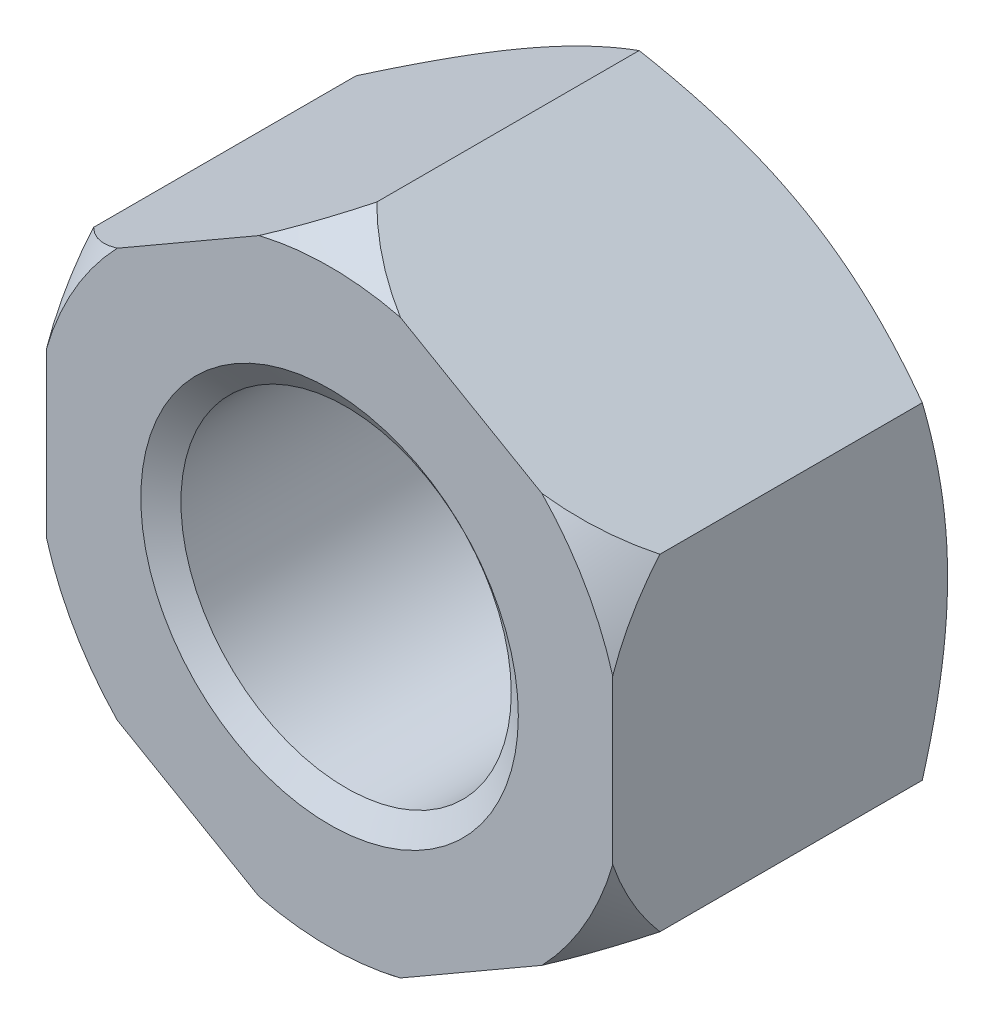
ISO-10303-21;
HEADER;
FILE_DESCRIPTION(('STEP AP214'),'2;1');
FILE_NAME('part.step','',(''),(''),'','','');
FILE_SCHEMA(('AUTOMOTIVE_DESIGN { 1 0 10303 214 1 1 1 1 }'));
ENDSEC;
DATA;
#1=APPLICATION_CONTEXT('core data for automotive mechanical design processes');
#2=APPLICATION_PROTOCOL_DEFINITION('international standard','automotive_design',2000,#1);
#3=PRODUCT_CONTEXT('',#1,'mechanical');
#4=PRODUCT('Part','Part','',(#3));
#5=PRODUCT_RELATED_PRODUCT_CATEGORY('part','',(#4));
#6=PRODUCT_DEFINITION_FORMATION('','',#4);
#7=PRODUCT_DEFINITION_CONTEXT('part definition',#1,'design');
#8=PRODUCT_DEFINITION('design','',#6,#7);
#9=PRODUCT_DEFINITION_SHAPE('','',#8);
#10=(LENGTH_UNIT() NAMED_UNIT(*) SI_UNIT(.MILLI.,.METRE.));
#11=(NAMED_UNIT(*) PLANE_ANGLE_UNIT() SI_UNIT($,.RADIAN.));
#12=(NAMED_UNIT(*) SI_UNIT($,.STERADIAN.) SOLID_ANGLE_UNIT());
#13=UNCERTAINTY_MEASURE_WITH_UNIT(LENGTH_MEASURE(1.E-05),#10,'distance_accuracy_value','');
#14=(GEOMETRIC_REPRESENTATION_CONTEXT(3) GLOBAL_UNCERTAINTY_ASSIGNED_CONTEXT((#13)) GLOBAL_UNIT_ASSIGNED_CONTEXT((#10,
#11,#12)) REPRESENTATION_CONTEXT('',''));
#15=CARTESIAN_POINT('',(0.,0.,0.));
#16=DIRECTION('',(0.,0.,1.));
#17=DIRECTION('',(1.,0.,0.));
#18=AXIS2_PLACEMENT_3D('',#15,#16,#17);
#19=CARTESIAN_POINT('',(0.,0.,-22.5298));
#20=DIRECTION('',(0.,0.,1.));
#21=DIRECTION('',(1.,0.,0.));
#22=AXIS2_PLACEMENT_3D('',#19,#20,#21);
#23=CYLINDRICAL_SURFACE('',#22,11.1125);
#24=CARTESIAN_POINT('',(0.,0.,-1.11157946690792));
#25=DIRECTION('',(0.,0.,1.));
#26=DIRECTION('',(1.,0.,0.));
#27=AXIS2_PLACEMENT_3D('',#24,#25,#26);
#28=CIRCLE('',#27,11.1125);
#29=CARTESIAN_POINT('',(11.1125,0.,-1.11157946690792));
#30=VERTEX_POINT('',#29);
#31=EDGE_CURVE('E150',#30,#30,#28,.F.);
#32=ORIENTED_EDGE('',*,*,#31,.F.);
#33=EDGE_LOOP('',(#32));
#34=FACE_BOUND('',#33,.T.);
#35=CARTESIAN_POINT('',(0.,0.,-21.3928205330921));
#36=DIRECTION('',(0.,0.,-1.));
#37=DIRECTION('',(-1.,0.,0.));
#38=AXIS2_PLACEMENT_3D('',#35,#36,#37);
#39=CIRCLE('',#38,11.1125);
#40=CARTESIAN_POINT('',(-11.1125,0.,-21.3928205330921));
#41=VERTEX_POINT('',#40);
#42=EDGE_CURVE('E38',#41,#41,#39,.F.);
#43=ORIENTED_EDGE('',*,*,#42,.F.);
#44=EDGE_LOOP('',(#43));
#45=FACE_BOUND('',#44,.T.);
#46=ADVANCED_FACE('F33',(#34,#45),#23,.F.);
#47=CARTESIAN_POINT('',(0.,21.9970452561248,-22.5298));
#48=DIRECTION('',(0.,0.,-1.));
#49=DIRECTION('',(-1.,0.,0.));
#50=AXIS2_PLACEMENT_3D('',#47,#48,#49);
#51=PLANE('',#50);
#52=CARTESIAN_POINT('',(0.,0.,-22.5298));
#53=DIRECTION('',(0.,0.,-1.));
#54=DIRECTION('',(-1.,0.,0.));
#55=AXIS2_PLACEMENT_3D('',#52,#53,#54);
#56=CIRCLE('',#55,19.05);
#57=CARTESIAN_POINT('',(-19.05,0.,-22.5298));
#58=VERTEX_POINT('',#57);
#59=CARTESIAN_POINT('',(-9.52500000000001,-16.4977839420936,-22.5298));
#60=VERTEX_POINT('',#59);
#61=EDGE_CURVE('E193',#58,#60,#56,.F.);
#62=ORIENTED_EDGE('',*,*,#61,.F.);
#63=CARTESIAN_POINT('',(-9.52500000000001,16.4977839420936,-22.5298));
#64=VERTEX_POINT('',#63);
#65=EDGE_CURVE('E178',#64,#58,#56,.F.);
#66=ORIENTED_EDGE('',*,*,#65,.F.);
#67=CARTESIAN_POINT('',(9.52500000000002,16.4977839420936,-22.5298));
#68=VERTEX_POINT('',#67);
#69=EDGE_CURVE('E192',#68,#64,#56,.F.);
#70=ORIENTED_EDGE('',*,*,#69,.F.);
#71=CARTESIAN_POINT('',(0.,0.,-22.5298));
#72=DIRECTION('',(0.,0.,1.));
#73=DIRECTION('',(1.,0.,0.));
#74=AXIS2_PLACEMENT_3D('',#71,#72,#73);
#75=CIRCLE('',#74,19.05);
#76=CARTESIAN_POINT('',(19.05,0.,-22.5298));
#77=VERTEX_POINT('',#76);
#78=EDGE_CURVE('E225',#77,#68,#75,.T.);
#79=ORIENTED_EDGE('',*,*,#78,.F.);
#80=CARTESIAN_POINT('',(9.525,-16.4977839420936,-22.5298));
#81=VERTEX_POINT('',#80);
#82=EDGE_CURVE('E546',#81,#77,#56,.F.);
#83=ORIENTED_EDGE('',*,*,#82,.F.);
#84=EDGE_CURVE('E547',#60,#81,#56,.F.);
#85=ORIENTED_EDGE('',*,*,#84,.F.);
#86=EDGE_LOOP('',(#62,#66,#70,#79,#83,#85));
#87=FACE_BOUND('',#86,.T.);
#88=CARTESIAN_POINT('',(0.,0.,-22.5298));
#89=DIRECTION('',(0.,0.,-1.));
#90=DIRECTION('',(-1.,0.,0.));
#91=AXIS2_PLACEMENT_3D('',#88,#89,#90);
#92=CIRCLE('',#91,12.7);
#93=CARTESIAN_POINT('',(-12.7,0.,-22.5298));
#94=VERTEX_POINT('',#93);
#95=EDGE_CURVE('E199',#94,#94,#92,.F.);
#96=ORIENTED_EDGE('',*,*,#95,.T.);
#97=EDGE_LOOP('',(#96));
#98=FACE_BOUND('',#97,.T.);
#99=ADVANCED_FACE('F310',(#87,#98),#51,.T.);
#100=CARTESIAN_POINT('',(0.,21.9970452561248,0.));
#101=DIRECTION('',(0.,0.,-1.));
#102=DIRECTION('',(-1.,0.,0.));
#103=AXIS2_PLACEMENT_3D('',#100,#101,#102);
#104=PLANE('',#103);
#105=DIRECTION('',(0.,-1.,0.));
#106=VECTOR('',#105,1.);
#107=CARTESIAN_POINT('',(-19.05,10.9985226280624,0.));
#108=LINE('',#107,#106);
#109=CARTESIAN_POINT('',(-19.05,5.49926131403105,0.));
#110=VERTEX_POINT('',#109);
#111=CARTESIAN_POINT('',(-19.05,-5.49926131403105,0.));
#112=VERTEX_POINT('',#111);
#113=EDGE_CURVE('E360',#110,#112,#108,.T.);
#114=ORIENTED_EDGE('',*,*,#113,.T.);
#115=CARTESIAN_POINT('',(0.,0.,0.));
#116=DIRECTION('',(0.,0.,-1.));
#117=DIRECTION('',(-1.,0.,0.));
#118=AXIS2_PLACEMENT_3D('',#115,#116,#117);
#119=CIRCLE('',#118,19.8278686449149);
#120=CARTESIAN_POINT('',(-14.2874999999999,-13.7481532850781,0.));
#121=VERTEX_POINT('',#120);
#122=EDGE_CURVE('E11',#112,#121,#119,.F.);
#123=ORIENTED_EDGE('',*,*,#122,.T.);
#124=DIRECTION('',(0.866025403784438,-0.5,0.));
#125=VECTOR('',#124,1.);
#126=CARTESIAN_POINT('',(-19.05,-10.9985226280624,0.));
#127=LINE('',#126,#125);
#128=CARTESIAN_POINT('',(-4.76250000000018,-19.2474145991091,0.));
#129=VERTEX_POINT('',#128);
#130=EDGE_CURVE('E171',#121,#129,#127,.T.);
#131=ORIENTED_EDGE('',*,*,#130,.T.);
#132=CARTESIAN_POINT('',(4.76250000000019,-19.2474145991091,0.));
#133=VERTEX_POINT('',#132);
#134=EDGE_CURVE('E43',#129,#133,#119,.F.);
#135=ORIENTED_EDGE('',*,*,#134,.T.);
#136=DIRECTION('',(0.866025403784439,0.5,0.));
#137=VECTOR('',#136,1.);
#138=CARTESIAN_POINT('',(0.,-21.9970452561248,0.));
#139=LINE('',#138,#137);
#140=CARTESIAN_POINT('',(14.2874999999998,-13.7481532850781,0.));
#141=VERTEX_POINT('',#140);
#142=EDGE_CURVE('E167',#133,#141,#139,.T.);
#143=ORIENTED_EDGE('',*,*,#142,.T.);
#144=CARTESIAN_POINT('',(19.05,-5.49926131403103,0.));
#145=VERTEX_POINT('',#144);
#146=EDGE_CURVE('E165',#141,#145,#119,.F.);
#147=ORIENTED_EDGE('',*,*,#146,.T.);
#148=DIRECTION('',(0.,-1.,0.));
#149=VECTOR('',#148,1.);
#150=CARTESIAN_POINT('',(19.05,10.9985226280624,0.));
#151=LINE('',#150,#149);
#152=CARTESIAN_POINT('',(19.05,5.49926131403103,0.));
#153=VERTEX_POINT('',#152);
#154=EDGE_CURVE('E156',#153,#145,#151,.T.);
#155=ORIENTED_EDGE('',*,*,#154,.F.);
#156=CARTESIAN_POINT('',(0.,0.,0.));
#157=DIRECTION('',(0.,0.,1.));
#158=DIRECTION('',(1.,0.,0.));
#159=AXIS2_PLACEMENT_3D('',#156,#157,#158);
#160=CIRCLE('',#159,19.8278686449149);
#161=CARTESIAN_POINT('',(14.2874999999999,13.748153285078,0.));
#162=VERTEX_POINT('',#161);
#163=EDGE_CURVE('E141',#153,#162,#160,.T.);
#164=ORIENTED_EDGE('',*,*,#163,.T.);
#165=DIRECTION('',(-0.866025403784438,0.500000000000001,0.));
#166=VECTOR('',#165,1.);
#167=CARTESIAN_POINT('',(19.05,10.9985226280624,0.));
#168=LINE('',#167,#166);
#169=CARTESIAN_POINT('',(4.76250000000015,19.2474145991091,0.));
#170=VERTEX_POINT('',#169);
#171=EDGE_CURVE('E166',#162,#170,#168,.T.);
#172=ORIENTED_EDGE('',*,*,#171,.T.);
#173=CARTESIAN_POINT('',(-4.76250000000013,19.2474145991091,0.));
#174=VERTEX_POINT('',#173);
#175=EDGE_CURVE('E196',#170,#174,#119,.F.);
#176=ORIENTED_EDGE('',*,*,#175,.T.);
#177=DIRECTION('',(-0.866025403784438,-0.5,0.));
#178=VECTOR('',#177,1.);
#179=CARTESIAN_POINT('',(0.,21.9970452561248,0.));
#180=LINE('',#179,#178);
#181=CARTESIAN_POINT('',(-14.2874999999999,13.748153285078,0.));
#182=VERTEX_POINT('',#181);
#183=EDGE_CURVE('E286',#174,#182,#180,.T.);
#184=ORIENTED_EDGE('',*,*,#183,.T.);
#185=EDGE_CURVE('E45',#182,#110,#119,.F.);
#186=ORIENTED_EDGE('',*,*,#185,.T.);
#187=EDGE_LOOP('',(#114,#123,#131,#135,#143,#147,#155,#164,#172,#176,#184,#186));
#188=FACE_BOUND('',#187,.T.);
#189=CARTESIAN_POINT('',(0.,0.,0.));
#190=DIRECTION('',(0.,0.,1.));
#191=DIRECTION('',(1.,0.,0.));
#192=AXIS2_PLACEMENT_3D('',#189,#190,#191);
#193=CIRCLE('',#192,12.7);
#194=CARTESIAN_POINT('',(12.7,0.,0.));
#195=VERTEX_POINT('',#194);
#196=EDGE_CURVE('E198',#195,#195,#193,.T.);
#197=ORIENTED_EDGE('',*,*,#196,.F.);
#198=EDGE_LOOP('',(#197));
#199=FACE_BOUND('',#198,.T.);
#200=ADVANCED_FACE('F162',(#188,#199),#104,.F.);
#201=CARTESIAN_POINT('',(0.,21.9970452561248,-22.5298));
#202=DIRECTION('',(-0.5,0.866025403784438,0.));
#203=DIRECTION('',(-0.866025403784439,-0.5,0.));
#204=AXIS2_PLACEMENT_3D('',#201,#202,#203);
#205=PLANE('',#204);
#206=CARTESIAN_POINT('',(-9.52500000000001,16.4977839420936,-15.875));
#207=DIRECTION('',(-0.5,0.866025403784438,0.));
#208=DIRECTION('',(-0.866025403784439,-0.5,0.));
#209=AXIS2_PLACEMENT_3D('',#206,#207,#208);
#210=CIRCLE('',#209,16.8005208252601);
#211=CARTESIAN_POINT('',(0.,21.9970452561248,-3.17500000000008));
#212=VERTEX_POINT('',#211);
#213=EDGE_CURVE('E216',#212,#174,#210,.F.);
#214=ORIENTED_EDGE('',*,*,#213,.F.);
#215=DIRECTION('',(0.,0.,1.));
#216=VECTOR('',#215,1.);
#217=CARTESIAN_POINT('',(0.,21.9970452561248,-22.5298));
#218=LINE('',#217,#216);
#219=CARTESIAN_POINT('',(0.,21.9970452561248,-20.8283226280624));
#220=VERTEX_POINT('',#219);
#221=EDGE_CURVE('E175',#220,#212,#218,.T.);
#222=ORIENTED_EDGE('',*,*,#221,.F.);
#223=CARTESIAN_POINT('',(-19.0502,10.9984071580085,-20.8282559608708));
#224=CARTESIAN_POINT('',(-18.6314889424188,11.2401500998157,-20.9678165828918));
#225=CARTESIAN_POINT('',(-18.2111446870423,11.4828359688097,-21.1010441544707));
#226=CARTESIAN_POINT('',(-17.3670855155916,11.9701537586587,-21.3530728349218));
#227=CARTESIAN_POINT('',(-16.9433695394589,12.2147862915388,-21.4718691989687));
#228=CARTESIAN_POINT('',(-16.0917480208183,12.7064702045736,-21.6934385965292));
#229=CARTESIAN_POINT('',(-15.6638350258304,12.9535258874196,-21.7961737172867));
#230=CARTESIAN_POINT('',(-14.8050356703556,13.4493539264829,-21.9834145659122));
#231=CARTESIAN_POINT('',(-14.374149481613,13.6981261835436,-22.0679213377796));
#232=CARTESIAN_POINT('',(-13.5204444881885,14.1910129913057,-22.2151111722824));
#233=CARTESIAN_POINT('',(-13.0976890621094,14.4350909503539,-22.2782814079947));
#234=CARTESIAN_POINT('',(-12.250241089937,14.9243652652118,-22.3842036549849));
#235=CARTESIAN_POINT('',(-11.8255485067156,15.1695616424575,-22.4269552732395));
#236=CARTESIAN_POINT('',(-10.9754499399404,15.6603662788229,-22.4909608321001));
#237=CARTESIAN_POINT('',(-10.5500454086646,15.9059736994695,-22.5122403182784));
#238=CARTESIAN_POINT('',(-9.69884369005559,16.397415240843,-22.532843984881));
#239=CARTESIAN_POINT('',(-9.27304651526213,16.6432493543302,-22.5321688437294));
#240=CARTESIAN_POINT('',(-8.47700964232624,17.1028414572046,-22.5103966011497));
#241=CARTESIAN_POINT('',(-8.10671322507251,17.316632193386,-22.4919544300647));
#242=CARTESIAN_POINT('',(-7.3670036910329,17.7437036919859,-22.4388155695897));
#243=CARTESIAN_POINT('',(-6.99759056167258,17.9569844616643,-22.404119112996));
#244=CARTESIAN_POINT('',(-6.25978756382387,18.3829552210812,-22.3190737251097));
#245=CARTESIAN_POINT('',(-5.89139892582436,18.5956445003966,-22.2687106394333));
#246=CARTESIAN_POINT('',(-5.1563753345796,19.0200105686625,-22.1532206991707));
#247=CARTESIAN_POINT('',(-4.7897403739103,19.2316873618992,-22.0880939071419));
#248=CARTESIAN_POINT('',(-3.67677271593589,19.8742595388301,-21.8689116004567));
#249=CARTESIAN_POINT('',(-2.93366305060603,20.3032941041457,-21.6930008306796));
#250=CARTESIAN_POINT('',(-1.45852420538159,21.1549659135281,-21.2937556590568));
#251=CARTESIAN_POINT('',(-0.726476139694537,21.5776140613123,-21.0705150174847));
#252=CARTESIAN_POINT('',(0.000200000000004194,21.9971607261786,-20.8282559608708));
#253=B_SPLINE_CURVE_WITH_KNOTS('',3,(#223,#224,#225,#226,#227,#228,#229,#230,#231,#232,#233,
#234,#235,#236,#237,#238,#239,#240,#241,#242,#243,#244,#245,#246,#247,#248,#249,#250,#251,#252),
.UNSPECIFIED.,.F.,.F.,(4,2,2,2,2,2,2,2,2,2,2,2,2,2,4),(0.,1.50971559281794,3.01992622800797,
4.53364959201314,6.04728623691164,7.52356313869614,8.99986845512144,10.4744153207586,
11.9489166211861,13.2325441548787,14.5161533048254,15.8009255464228,17.085692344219,
19.7118183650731,22.3327898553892),.UNSPECIFIED.);
#254=EDGE_CURVE('E278',#64,#220,#253,.T.);
#255=ORIENTED_EDGE('',*,*,#254,.F.);
#256=CARTESIAN_POINT('',(-19.05,10.9985226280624,-20.8283226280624));
#257=VERTEX_POINT('',#256);
#258=EDGE_CURVE('E272',#257,#64,#253,.T.);
#259=ORIENTED_EDGE('',*,*,#258,.F.);
#260=DIRECTION('',(0.,0.,1.));
#261=VECTOR('',#260,1.);
#262=CARTESIAN_POINT('',(-19.05,10.9985226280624,-22.5298));
#263=LINE('',#262,#261);
#264=CARTESIAN_POINT('',(-19.05,10.9985226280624,-3.17500000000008));
#265=VERTEX_POINT('',#264);
#266=EDGE_CURVE('E169',#257,#265,#263,.T.);
#267=ORIENTED_EDGE('',*,*,#266,.T.);
#268=EDGE_CURVE('E213',#182,#265,#210,.F.);
#269=ORIENTED_EDGE('',*,*,#268,.F.);
#270=ORIENTED_EDGE('',*,*,#183,.F.);
#271=EDGE_LOOP('',(#214,#222,#255,#259,#267,#269,#270));
#272=FACE_BOUND('',#271,.T.);
#273=ADVANCED_FACE('F35',(#272),#205,.T.);
#274=CARTESIAN_POINT('',(19.05,10.9985226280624,-22.5298));
#275=DIRECTION('',(0.500000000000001,0.866025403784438,0.));
#276=DIRECTION('',(-0.866025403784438,0.500000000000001,0.));
#277=AXIS2_PLACEMENT_3D('',#274,#275,#276);
#278=PLANE('',#277);
#279=CARTESIAN_POINT('',(9.52500000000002,16.4977839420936,-15.875));
#280=DIRECTION('',(0.500000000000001,0.866025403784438,0.));
#281=DIRECTION('',(-0.866025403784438,0.500000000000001,0.));
#282=AXIS2_PLACEMENT_3D('',#279,#280,#281);
#283=CIRCLE('',#282,16.8005208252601);
#284=CARTESIAN_POINT('',(19.05,10.9985226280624,-3.17500000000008));
#285=VERTEX_POINT('',#284);
#286=EDGE_CURVE('E52',#285,#162,#283,.F.);
#287=ORIENTED_EDGE('',*,*,#286,.F.);
#288=DIRECTION('',(0.,0.,1.));
#289=VECTOR('',#288,1.);
#290=CARTESIAN_POINT('',(19.05,10.9985226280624,-22.5298));
#291=LINE('',#290,#289);
#292=CARTESIAN_POINT('',(19.05,10.9985226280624,-20.8283226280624));
#293=VERTEX_POINT('',#292);
#294=EDGE_CURVE('E159',#293,#285,#291,.T.);
#295=ORIENTED_EDGE('',*,*,#294,.F.);
#296=CARTESIAN_POINT('',(-0.000199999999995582,21.9971607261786,-20.8282559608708));
#297=CARTESIAN_POINT('',(0.418511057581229,21.7554177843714,-20.9678165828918));
#298=CARTESIAN_POINT('',(0.838855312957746,21.5127319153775,-21.1010441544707));
#299=CARTESIAN_POINT('',(1.68291448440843,21.0254141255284,-21.3530728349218));
#300=CARTESIAN_POINT('',(2.10663046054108,20.7807815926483,-21.4718691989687));
#301=CARTESIAN_POINT('',(2.95825197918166,20.2890976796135,-21.6934385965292));
#302=CARTESIAN_POINT('',(3.38616497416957,20.0420419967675,-21.7961737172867));
#303=CARTESIAN_POINT('',(4.24496432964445,19.5462139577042,-21.9834145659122));
#304=CARTESIAN_POINT('',(4.67585051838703,19.2974417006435,-22.0679213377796));
#305=CARTESIAN_POINT('',(5.52955551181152,18.8045548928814,-22.2151111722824));
#306=CARTESIAN_POINT('',(5.95231093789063,18.5604769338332,-22.2782814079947));
#307=CARTESIAN_POINT('',(6.799758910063,18.0712026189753,-22.3842036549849));
#308=CARTESIAN_POINT('',(7.22445149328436,17.8260062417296,-22.4269552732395));
#309=CARTESIAN_POINT('',(8.07455006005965,17.3352016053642,-22.4909608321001));
#310=CARTESIAN_POINT('',(8.49995459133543,17.0895941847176,-22.5122403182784));
#311=CARTESIAN_POINT('',(9.35115630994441,16.5981526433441,-22.532843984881));
#312=CARTESIAN_POINT('',(9.77695348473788,16.3523185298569,-22.5321688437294));
#313=CARTESIAN_POINT('',(10.5729903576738,15.8927264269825,-22.5103966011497));
#314=CARTESIAN_POINT('',(10.9432867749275,15.6789356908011,-22.4919544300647));
#315=CARTESIAN_POINT('',(11.6829963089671,15.2518641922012,-22.4388155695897));
#316=CARTESIAN_POINT('',(12.0524094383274,15.0385834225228,-22.4041191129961));
#317=CARTESIAN_POINT('',(12.7902124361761,14.612612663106,-22.3190737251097));
#318=CARTESIAN_POINT('',(13.1586010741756,14.3999233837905,-22.2687106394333));
#319=CARTESIAN_POINT('',(13.8936246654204,13.9755573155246,-22.1532206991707));
#320=CARTESIAN_POINT('',(14.2602596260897,13.7638805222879,-22.0880939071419));
#321=CARTESIAN_POINT('',(15.3732272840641,13.121308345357,-21.8689116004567));
#322=CARTESIAN_POINT('',(16.116336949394,12.6922737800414,-21.6930008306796));
#323=CARTESIAN_POINT('',(17.5914757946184,11.840601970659,-21.2937556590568));
#324=CARTESIAN_POINT('',(18.3235238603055,11.4179538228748,-21.0705150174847));
#325=CARTESIAN_POINT('',(19.0502,10.9984071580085,-20.8282559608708));
#326=B_SPLINE_CURVE_WITH_KNOTS('',3,(#296,#297,#298,#299,#300,#301,#302,#303,#304,#305,#306,
#307,#308,#309,#310,#311,#312,#313,#314,#315,#316,#317,#318,#319,#320,#321,#322,#323,#324,#325),
.UNSPECIFIED.,.F.,.F.,(4,2,2,2,2,2,2,2,2,2,2,2,2,2,4),(0.,1.50971559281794,3.01992622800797,
4.53364959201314,6.04728623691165,7.52356313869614,8.99986845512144,10.4744153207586,
11.9489166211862,13.2325441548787,14.5161533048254,15.8009255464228,17.085692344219,
19.7118183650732,22.3327898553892),.UNSPECIFIED.);
#327=EDGE_CURVE('E279',#68,#293,#326,.T.);
#328=ORIENTED_EDGE('',*,*,#327,.F.);
#329=EDGE_CURVE('E285',#220,#68,#326,.T.);
#330=ORIENTED_EDGE('',*,*,#329,.F.);
#331=ORIENTED_EDGE('',*,*,#221,.T.);
#332=EDGE_CURVE('E224',#170,#212,#283,.F.);
#333=ORIENTED_EDGE('',*,*,#332,.F.);
#334=ORIENTED_EDGE('',*,*,#171,.F.);
#335=EDGE_LOOP('',(#287,#295,#328,#330,#331,#333,#334));
#336=FACE_BOUND('',#335,.T.);
#337=ADVANCED_FACE('F288',(#336),#278,.T.);
#338=CARTESIAN_POINT('',(19.05,10.9985226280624,-22.5298));
#339=DIRECTION('',(-1.,0.,0.));
#340=DIRECTION('',(0.,0.,1.));
#341=AXIS2_PLACEMENT_3D('',#338,#339,#340);
#342=PLANE('',#341);
#343=ORIENTED_EDGE('',*,*,#154,.T.);
#344=CARTESIAN_POINT('',(19.05,0.,-15.875));
#345=DIRECTION('',(-1.,0.,0.));
#346=DIRECTION('',(0.,0.,1.));
#347=AXIS2_PLACEMENT_3D('',#344,#345,#346);
#348=CIRCLE('',#347,16.8005208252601);
#349=CARTESIAN_POINT('',(19.05,-10.9985226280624,-3.17500000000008));
#350=VERTEX_POINT('',#349);
#351=EDGE_CURVE('E60',#145,#350,#348,.F.);
#352=ORIENTED_EDGE('',*,*,#351,.T.);
#353=DIRECTION('',(0.,0.,1.));
#354=VECTOR('',#353,1.);
#355=CARTESIAN_POINT('',(19.05,-10.9985226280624,-22.5298));
#356=LINE('',#355,#354);
#357=CARTESIAN_POINT('',(19.05,-10.9985226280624,-20.8283226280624));
#358=VERTEX_POINT('',#357);
#359=EDGE_CURVE('E180',#358,#350,#356,.T.);
#360=ORIENTED_EDGE('',*,*,#359,.F.);
#361=CARTESIAN_POINT('',(19.05,-29.169702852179,-13.4138662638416));
#362=CARTESIAN_POINT('',(19.05,-28.7515170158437,-13.6160110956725));
#363=CARTESIAN_POINT('',(19.05,-28.3328257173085,-13.8171097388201));
#364=CARTESIAN_POINT('',(19.05,-27.494325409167,-14.2169745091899));
#365=CARTESIAN_POINT('',(19.05,-27.0745163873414,-14.4157406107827));
#366=CARTESIAN_POINT('',(19.05,-25.8131296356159,-15.0082374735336));
#367=CARTESIAN_POINT('',(19.05,-24.9697281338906,-15.3981009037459));
#368=CARTESIAN_POINT('',(19.05,-23.2722707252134,-16.1672287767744));
#369=CARTESIAN_POINT('',(19.05,-22.4181814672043,-16.546419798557));
#370=CARTESIAN_POINT('',(19.05,-20.7029839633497,-17.2885211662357));
#371=CARTESIAN_POINT('',(19.05,-19.8418760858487,-17.6514323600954));
#372=CARTESIAN_POINT('',(19.05,-18.1005821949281,-18.3609430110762));
#373=CARTESIAN_POINT('',(19.05,-17.2202917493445,-18.7072875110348));
#374=CARTESIAN_POINT('',(19.05,-15.4493217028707,-19.3728520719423));
#375=CARTESIAN_POINT('',(19.05,-14.5586409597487,-19.6920691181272));
#376=CARTESIAN_POINT('',(19.05,-12.7673320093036,-20.2947971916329));
#377=CARTESIAN_POINT('',(19.05,-11.8667295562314,-20.5783841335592));
#378=CARTESIAN_POINT('',(19.05,-10.0526343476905,-21.1006560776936));
#379=CARTESIAN_POINT('',(19.05,-9.13914576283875,-21.3393552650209));
#380=CARTESIAN_POINT('',(19.05,-7.7590746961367,-21.6550001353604));
#381=CARTESIAN_POINT('',(19.05,-7.29731333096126,-21.7531639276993));
#382=CARTESIAN_POINT('',(19.05,-6.37071732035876,-21.9338068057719));
#383=CARTESIAN_POINT('',(19.05,-5.90588274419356,-22.0162862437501));
#384=CARTESIAN_POINT('',(19.05,-4.97345228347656,-22.164098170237));
#385=CARTESIAN_POINT('',(19.05,-4.50585623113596,-22.2294296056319));
#386=CARTESIAN_POINT('',(19.05,-3.56843861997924,-22.3416333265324));
#387=CARTESIAN_POINT('',(19.05,-3.09861705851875,-22.388505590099));
#388=CARTESIAN_POINT('',(19.05,-2.16041609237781,-22.4625291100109));
#389=CARTESIAN_POINT('',(19.05,-1.6920464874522,-22.4898037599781));
#390=CARTESIAN_POINT('',(19.05,-0.754574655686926,-22.5244886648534));
#391=CARTESIAN_POINT('',(19.05,-0.28547244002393,-22.5318992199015));
#392=CARTESIAN_POINT('',(19.05,0.652492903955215,-22.5266801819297));
#393=CARTESIAN_POINT('',(19.05,1.1213560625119,-22.5140561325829));
#394=CARTESIAN_POINT('',(19.05,2.05813737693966,-22.4690817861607));
#395=CARTESIAN_POINT('',(19.05,2.52605549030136,-22.4367306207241));
#396=CARTESIAN_POINT('',(19.05,3.65980250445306,-22.3351199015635));
#397=CARTESIAN_POINT('',(19.05,4.32476458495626,-22.2559962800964));
#398=CARTESIAN_POINT('',(19.05,5.64947952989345,-22.0623146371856));
#399=CARTESIAN_POINT('',(19.05,6.30923160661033,-21.9477513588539));
#400=CARTESIAN_POINT('',(19.05,8.2818238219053,-21.556648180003));
#401=CARTESIAN_POINT('',(19.05,9.58542312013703,-21.2329552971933));
#402=CARTESIAN_POINT('',(19.05,11.5353898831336,-20.6748015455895));
#403=CARTESIAN_POINT('',(19.05,12.191945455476,-20.4739165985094));
#404=CARTESIAN_POINT('',(19.05,13.498713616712,-20.0521176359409));
#405=CARTESIAN_POINT('',(19.05,14.1489256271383,-19.8312018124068));
#406=CARTESIAN_POINT('',(19.05,15.4397656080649,-19.3740482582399));
#407=CARTESIAN_POINT('',(19.05,16.0804269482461,-19.1379039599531));
#408=CARTESIAN_POINT('',(19.05,17.0373840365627,-18.7734634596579));
#409=CARTESIAN_POINT('',(19.05,17.3556458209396,-18.650300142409));
#410=CARTESIAN_POINT('',(19.05,17.9909330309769,-18.4008420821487));
#411=CARTESIAN_POINT('',(19.05,18.3079584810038,-18.2745474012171));
#412=CARTESIAN_POINT('',(19.05,18.6244086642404,-18.1468283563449));
#413=B_SPLINE_CURVE_WITH_KNOTS('',3,(#361,#362,#363,#364,#365,#366,#367,#368,#369,#370,#371,
#372,#373,#374,#375,#376,#377,#378,#379,#380,#381,#382,#383,#384,#385,#386,#387,#388,#389,#390,
#391,#392,#393,#394,#395,#396,#397,#398,#399,#400,#401,#402,#403,#404,#405,#406,#407,#408,#409,
#410,#411,#412),.UNSPECIFIED.,.F.,.F.,(4,2,2,2,2,2,2,2,2,2,2,2,2,2,2,2,2,2,2,2,2,2,2,2,2,4),(0.,
1.39343811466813,2.78689152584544,5.57425145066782,8.37756231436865,11.1807269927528,
14.0183059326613,16.856199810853,19.6879407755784,22.5187853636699,23.934802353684,
25.3507875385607,26.766859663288,28.1829334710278,29.5900111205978,30.9970675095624,
32.4037346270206,33.8104636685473,35.8182820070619,37.8263983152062,41.8503661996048,
43.9100054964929,45.9698308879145,48.0180400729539,49.0418117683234,50.0655631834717),.UNSPECIFIED.);
#414=EDGE_CURVE('E266',#358,#77,#413,.T.);
#415=ORIENTED_EDGE('',*,*,#414,.T.);
#416=EDGE_CURVE('E277',#77,#293,#413,.T.);
#417=ORIENTED_EDGE('',*,*,#416,.T.);
#418=ORIENTED_EDGE('',*,*,#294,.T.);
#419=EDGE_CURVE('E144',#285,#153,#348,.F.);
#420=ORIENTED_EDGE('',*,*,#419,.T.);
#421=EDGE_LOOP('',(#343,#352,#360,#415,#417,#418,#420));
#422=FACE_BOUND('',#421,.T.);
#423=ADVANCED_FACE('F155',(#422),#342,.F.);
#424=CARTESIAN_POINT('',(0.,-21.9970452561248,-22.5298));
#425=DIRECTION('',(0.5,-0.866025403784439,0.));
#426=DIRECTION('',(0.866025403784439,0.5,0.));
#427=AXIS2_PLACEMENT_3D('',#424,#425,#426);
#428=PLANE('',#427);
#429=CARTESIAN_POINT('',(9.52500000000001,-16.4977839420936,-15.875));
#430=DIRECTION('',(0.5,-0.866025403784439,0.));
#431=DIRECTION('',(0.866025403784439,0.5,0.));
#432=AXIS2_PLACEMENT_3D('',#429,#430,#431);
#433=CIRCLE('',#432,16.8005208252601);
#434=CARTESIAN_POINT('',(0.,-21.9970452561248,-3.17500000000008));
#435=VERTEX_POINT('',#434);
#436=EDGE_CURVE('E220',#435,#133,#433,.F.);
#437=ORIENTED_EDGE('',*,*,#436,.F.);
#438=DIRECTION('',(0.,0.,1.));
#439=VECTOR('',#438,1.);
#440=CARTESIAN_POINT('',(0.,-21.9970452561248,-22.5298));
#441=LINE('',#440,#439);
#442=CARTESIAN_POINT('',(0.,-21.9970452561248,-20.8283226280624));
#443=VERTEX_POINT('',#442);
#444=EDGE_CURVE('E183',#443,#435,#441,.T.);
#445=ORIENTED_EDGE('',*,*,#444,.F.);
#446=CARTESIAN_POINT('',(19.0502,-10.9984071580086,-20.8282559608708));
#447=CARTESIAN_POINT('',(18.6314889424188,-11.2401500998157,-20.9678165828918));
#448=CARTESIAN_POINT('',(18.2111446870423,-11.4828359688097,-21.1010441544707));
#449=CARTESIAN_POINT('',(17.3670855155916,-11.9701537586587,-21.3530728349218));
#450=CARTESIAN_POINT('',(16.9433695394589,-12.2147862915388,-21.4718691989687));
#451=CARTESIAN_POINT('',(16.0917480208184,-12.7064702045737,-21.6934385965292));
#452=CARTESIAN_POINT('',(15.6638350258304,-12.9535258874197,-21.7961737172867));
#453=CARTESIAN_POINT('',(14.8050356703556,-13.449353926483,-21.9834145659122));
#454=CARTESIAN_POINT('',(14.374149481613,-13.6981261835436,-22.0679213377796));
#455=CARTESIAN_POINT('',(13.5204444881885,-14.1910129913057,-22.2151111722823));
#456=CARTESIAN_POINT('',(13.0976890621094,-14.4350909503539,-22.2782814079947));
#457=CARTESIAN_POINT('',(12.250241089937,-14.9243652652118,-22.3842036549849));
#458=CARTESIAN_POINT('',(11.8255485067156,-15.1695616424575,-22.4269552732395));
#459=CARTESIAN_POINT('',(10.9754499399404,-15.6603662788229,-22.4909608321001));
#460=CARTESIAN_POINT('',(10.5500454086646,-15.9059736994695,-22.5122403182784));
#461=CARTESIAN_POINT('',(9.69884369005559,-16.3974152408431,-22.532843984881));
#462=CARTESIAN_POINT('',(9.27304651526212,-16.6432493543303,-22.5321688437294));
#463=CARTESIAN_POINT('',(8.47700964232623,-17.1028414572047,-22.5103966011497));
#464=CARTESIAN_POINT('',(8.10671322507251,-17.3166321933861,-22.4919544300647));
#465=CARTESIAN_POINT('',(7.36700369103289,-17.743703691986,-22.4388155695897));
#466=CARTESIAN_POINT('',(6.99759056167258,-17.9569844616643,-22.404119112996));
#467=CARTESIAN_POINT('',(6.25978756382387,-18.3829552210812,-22.3190737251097));
#468=CARTESIAN_POINT('',(5.89139892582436,-18.5956445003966,-22.2687106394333));
#469=CARTESIAN_POINT('',(5.1563753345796,-19.0200105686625,-22.1532206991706));
#470=CARTESIAN_POINT('',(4.7897403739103,-19.2316873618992,-22.0880939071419));
#471=CARTESIAN_POINT('',(3.67677271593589,-19.8742595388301,-21.8689116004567));
#472=CARTESIAN_POINT('',(2.93366305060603,-20.3032941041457,-21.6930008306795));
#473=CARTESIAN_POINT('',(1.45852420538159,-21.1549659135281,-21.2937556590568));
#474=CARTESIAN_POINT('',(0.726476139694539,-21.5776140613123,-21.0705150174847));
#475=CARTESIAN_POINT('',(-0.000200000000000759,-21.9971607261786,-20.8282559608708));
#476=B_SPLINE_CURVE_WITH_KNOTS('',3,(#446,#447,#448,#449,#450,#451,#452,#453,#454,#455,#456,
#457,#458,#459,#460,#461,#462,#463,#464,#465,#466,#467,#468,#469,#470,#471,#472,#473,#474,#475),
.UNSPECIFIED.,.F.,.F.,(4,2,2,2,2,2,2,2,2,2,2,2,2,2,4),(0.,1.50971559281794,3.01992622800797,
4.53364959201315,6.04728623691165,7.52356313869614,8.99986845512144,10.4744153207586,
11.9489166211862,13.2325441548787,14.5161533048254,15.8009255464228,17.085692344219,
19.7118183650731,22.3327898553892),.UNSPECIFIED.);
#477=EDGE_CURVE('E260',#81,#443,#476,.T.);
#478=ORIENTED_EDGE('',*,*,#477,.F.);
#479=EDGE_CURVE('E380',#358,#81,#476,.T.);
#480=ORIENTED_EDGE('',*,*,#479,.F.);
#481=ORIENTED_EDGE('',*,*,#359,.T.);
#482=EDGE_CURVE('E221',#141,#350,#433,.F.);
#483=ORIENTED_EDGE('',*,*,#482,.F.);
#484=ORIENTED_EDGE('',*,*,#142,.F.);
#485=EDGE_LOOP('',(#437,#445,#478,#480,#481,#483,#484));
#486=FACE_BOUND('',#485,.T.);
#487=ADVANCED_FACE('F295',(#486),#428,.T.);
#488=CARTESIAN_POINT('',(-19.05,-10.9985226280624,-22.5298));
#489=DIRECTION('',(-0.5,-0.866025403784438,0.));
#490=DIRECTION('',(0.866025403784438,-0.5,0.));
#491=AXIS2_PLACEMENT_3D('',#488,#489,#490);
#492=PLANE('',#491);
#493=CARTESIAN_POINT('',(-9.52500000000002,-16.4977839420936,-15.875));
#494=DIRECTION('',(-0.5,-0.866025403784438,0.));
#495=DIRECTION('',(0.866025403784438,-0.5,0.));
#496=AXIS2_PLACEMENT_3D('',#493,#494,#495);
#497=CIRCLE('',#496,16.8005208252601);
#498=CARTESIAN_POINT('',(-19.05,-10.9985226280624,-3.17500000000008));
#499=VERTEX_POINT('',#498);
#500=EDGE_CURVE('E217',#499,#121,#497,.F.);
#501=ORIENTED_EDGE('',*,*,#500,.F.);
#502=DIRECTION('',(0.,0.,1.));
#503=VECTOR('',#502,1.);
#504=CARTESIAN_POINT('',(-19.05,-10.9985226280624,-22.5298));
#505=LINE('',#504,#503);
#506=CARTESIAN_POINT('',(-19.05,-10.9985226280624,-20.8283226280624));
#507=VERTEX_POINT('',#506);
#508=EDGE_CURVE('E186',#507,#499,#505,.T.);
#509=ORIENTED_EDGE('',*,*,#508,.F.);
#510=CARTESIAN_POINT('',(0.00019999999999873,-21.9971607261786,-20.8282559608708));
#511=CARTESIAN_POINT('',(-0.418511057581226,-21.7554177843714,-20.9678165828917));
#512=CARTESIAN_POINT('',(-0.838855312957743,-21.5127319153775,-21.1010441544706));
#513=CARTESIAN_POINT('',(-1.68291448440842,-21.0254141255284,-21.3530728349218));
#514=CARTESIAN_POINT('',(-2.10663046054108,-20.7807815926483,-21.4718691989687));
#515=CARTESIAN_POINT('',(-2.95825197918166,-20.2890976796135,-21.6934385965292));
#516=CARTESIAN_POINT('',(-3.38616497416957,-20.0420419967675,-21.7961737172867));
#517=CARTESIAN_POINT('',(-4.24496432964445,-19.5462139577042,-21.9834145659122));
#518=CARTESIAN_POINT('',(-4.67585051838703,-19.2974417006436,-22.0679213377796));
#519=CARTESIAN_POINT('',(-5.52955551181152,-18.8045548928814,-22.2151111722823));
#520=CARTESIAN_POINT('',(-5.95231093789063,-18.5604769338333,-22.2782814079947));
#521=CARTESIAN_POINT('',(-6.799758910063,-18.0712026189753,-22.3842036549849));
#522=CARTESIAN_POINT('',(-7.22445149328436,-17.8260062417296,-22.4269552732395));
#523=CARTESIAN_POINT('',(-8.07455006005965,-17.3352016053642,-22.4909608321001));
#524=CARTESIAN_POINT('',(-8.49995459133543,-17.0895941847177,-22.5122403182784));
#525=CARTESIAN_POINT('',(-9.35115630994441,-16.5981526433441,-22.532843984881));
#526=CARTESIAN_POINT('',(-9.77695348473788,-16.3523185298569,-22.5321688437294));
#527=CARTESIAN_POINT('',(-10.5729903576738,-15.8927264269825,-22.5103966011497));
#528=CARTESIAN_POINT('',(-10.9432867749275,-15.6789356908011,-22.4919544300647));
#529=CARTESIAN_POINT('',(-11.6829963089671,-15.2518641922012,-22.4388155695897));
#530=CARTESIAN_POINT('',(-12.0524094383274,-15.0385834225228,-22.404119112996));
#531=CARTESIAN_POINT('',(-12.7902124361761,-14.612612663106,-22.3190737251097));
#532=CARTESIAN_POINT('',(-13.1586010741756,-14.3999233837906,-22.2687106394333));
#533=CARTESIAN_POINT('',(-13.8936246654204,-13.9755573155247,-22.1532206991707));
#534=CARTESIAN_POINT('',(-14.2602596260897,-13.7638805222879,-22.0880939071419));
#535=CARTESIAN_POINT('',(-15.3732272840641,-13.121308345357,-21.8689116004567));
#536=CARTESIAN_POINT('',(-16.116336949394,-12.6922737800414,-21.6930008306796));
#537=CARTESIAN_POINT('',(-17.5914757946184,-11.840601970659,-21.2937556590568));
#538=CARTESIAN_POINT('',(-18.3235238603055,-11.4179538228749,-21.0705150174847));
#539=CARTESIAN_POINT('',(-19.0502,-10.9984071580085,-20.8282559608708));
#540=B_SPLINE_CURVE_WITH_KNOTS('',3,(#510,#511,#512,#513,#514,#515,#516,#517,#518,#519,#520,
#521,#522,#523,#524,#525,#526,#527,#528,#529,#530,#531,#532,#533,#534,#535,#536,#537,#538,#539),
.UNSPECIFIED.,.F.,.F.,(4,2,2,2,2,2,2,2,2,2,2,2,2,2,4),(0.,1.50971559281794,3.01992622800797,
4.53364959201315,6.04728623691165,7.52356313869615,8.99986845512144,10.4744153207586,
11.9489166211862,13.2325441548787,14.5161533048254,15.8009255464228,17.085692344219,
19.7118183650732,22.3327898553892),.UNSPECIFIED.);
#541=EDGE_CURVE('E235',#60,#507,#540,.T.);
#542=ORIENTED_EDGE('',*,*,#541,.F.);
#543=EDGE_CURVE('E382',#443,#60,#540,.T.);
#544=ORIENTED_EDGE('',*,*,#543,.F.);
#545=ORIENTED_EDGE('',*,*,#444,.T.);
#546=EDGE_CURVE('E219',#129,#435,#497,.F.);
#547=ORIENTED_EDGE('',*,*,#546,.F.);
#548=ORIENTED_EDGE('',*,*,#130,.F.);
#549=EDGE_LOOP('',(#501,#509,#542,#544,#545,#547,#548));
#550=FACE_BOUND('',#549,.T.);
#551=ADVANCED_FACE('F298',(#550),#492,.T.);
#552=CARTESIAN_POINT('',(-19.05,10.9985226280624,-22.5298));
#553=DIRECTION('',(-1.,0.,0.));
#554=DIRECTION('',(0.,0.,1.));
#555=AXIS2_PLACEMENT_3D('',#552,#553,#554);
#556=PLANE('',#555);
#557=CARTESIAN_POINT('',(-19.05,0.,-15.875));
#558=DIRECTION('',(-1.,0.,0.));
#559=DIRECTION('',(0.,0.,1.));
#560=AXIS2_PLACEMENT_3D('',#557,#558,#559);
#561=CIRCLE('',#560,16.8005208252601);
#562=EDGE_CURVE('E214',#112,#499,#561,.F.);
#563=ORIENTED_EDGE('',*,*,#562,.F.);
#564=ORIENTED_EDGE('',*,*,#113,.F.);
#565=EDGE_CURVE('E149',#265,#110,#561,.F.);
#566=ORIENTED_EDGE('',*,*,#565,.F.);
#567=ORIENTED_EDGE('',*,*,#266,.F.);
#568=CARTESIAN_POINT('',(-19.05,-29.169702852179,-13.4138662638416));
#569=CARTESIAN_POINT('',(-19.05,-28.7515170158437,-13.6160110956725));
#570=CARTESIAN_POINT('',(-19.05,-28.3328257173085,-13.8171097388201));
#571=CARTESIAN_POINT('',(-19.05,-27.494325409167,-14.2169745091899));
#572=CARTESIAN_POINT('',(-19.05,-27.0745163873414,-14.4157406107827));
#573=CARTESIAN_POINT('',(-19.05,-25.8131296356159,-15.0082374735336));
#574=CARTESIAN_POINT('',(-19.05,-24.9697281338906,-15.3981009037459));
#575=CARTESIAN_POINT('',(-19.05,-23.2722707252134,-16.1672287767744));
#576=CARTESIAN_POINT('',(-19.05,-22.4181814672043,-16.546419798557));
#577=CARTESIAN_POINT('',(-19.05,-20.7029839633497,-17.2885211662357));
#578=CARTESIAN_POINT('',(-19.05,-19.8418760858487,-17.6514323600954));
#579=CARTESIAN_POINT('',(-19.05,-18.1005821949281,-18.3609430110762));
#580=CARTESIAN_POINT('',(-19.05,-17.2202917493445,-18.7072875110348));
#581=CARTESIAN_POINT('',(-19.05,-15.4493217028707,-19.3728520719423));
#582=CARTESIAN_POINT('',(-19.05,-14.5586409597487,-19.6920691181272));
#583=CARTESIAN_POINT('',(-19.05,-12.7673320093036,-20.2947971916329));
#584=CARTESIAN_POINT('',(-19.05,-11.8667295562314,-20.5783841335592));
#585=CARTESIAN_POINT('',(-19.05,-10.0526343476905,-21.1006560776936));
#586=CARTESIAN_POINT('',(-19.05,-9.13914576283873,-21.3393552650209));
#587=CARTESIAN_POINT('',(-19.05,-7.75907469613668,-21.6550001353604));
#588=CARTESIAN_POINT('',(-19.05,-7.29731333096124,-21.7531639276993));
#589=CARTESIAN_POINT('',(-19.05,-6.37071732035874,-21.9338068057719));
#590=CARTESIAN_POINT('',(-19.05,-5.90588274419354,-22.0162862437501));
#591=CARTESIAN_POINT('',(-19.05,-4.97345228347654,-22.164098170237));
#592=CARTESIAN_POINT('',(-19.05,-4.50585623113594,-22.2294296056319));
#593=CARTESIAN_POINT('',(-19.05,-3.56843861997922,-22.3416333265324));
#594=CARTESIAN_POINT('',(-19.05,-3.09861705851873,-22.388505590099));
#595=CARTESIAN_POINT('',(-19.05,-2.16041609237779,-22.4625291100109));
#596=CARTESIAN_POINT('',(-19.05,-1.69204648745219,-22.4898037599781));
#597=CARTESIAN_POINT('',(-19.05,-0.754574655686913,-22.5244886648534));
#598=CARTESIAN_POINT('',(-19.05,-0.285472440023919,-22.5318992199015));
#599=CARTESIAN_POINT('',(-19.05,0.652492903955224,-22.5266801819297));
#600=CARTESIAN_POINT('',(-19.05,1.12135606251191,-22.5140561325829));
#601=CARTESIAN_POINT('',(-19.05,2.05813737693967,-22.4690817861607));
#602=CARTESIAN_POINT('',(-19.05,2.52605549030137,-22.4367306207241));
#603=CARTESIAN_POINT('',(-19.05,3.65980250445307,-22.3351199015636));
#604=CARTESIAN_POINT('',(-19.05,4.32476458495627,-22.2559962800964));
#605=CARTESIAN_POINT('',(-19.05,5.64947952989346,-22.0623146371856));
#606=CARTESIAN_POINT('',(-19.05,6.30923160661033,-21.9477513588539));
#607=CARTESIAN_POINT('',(-19.05,8.28182382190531,-21.556648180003));
#608=CARTESIAN_POINT('',(-19.05,9.58542312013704,-21.2329552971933));
#609=CARTESIAN_POINT('',(-19.05,11.5353898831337,-20.6748015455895));
#610=CARTESIAN_POINT('',(-19.05,12.191945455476,-20.4739165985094));
#611=CARTESIAN_POINT('',(-19.05,13.498713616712,-20.0521176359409));
#612=CARTESIAN_POINT('',(-19.05,14.1489256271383,-19.8312018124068));
#613=CARTESIAN_POINT('',(-19.05,15.439765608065,-19.3740482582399));
#614=CARTESIAN_POINT('',(-19.05,16.0804269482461,-19.1379039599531));
#615=CARTESIAN_POINT('',(-19.05,17.0373840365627,-18.7734634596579));
#616=CARTESIAN_POINT('',(-19.05,17.3556458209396,-18.650300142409));
#617=CARTESIAN_POINT('',(-19.05,17.9909330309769,-18.4008420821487));
#618=CARTESIAN_POINT('',(-19.05,18.3079584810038,-18.2745474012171));
#619=CARTESIAN_POINT('',(-19.05,18.6244086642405,-18.1468283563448));
#620=B_SPLINE_CURVE_WITH_KNOTS('',3,(#568,#569,#570,#571,#572,#573,#574,#575,#576,#577,#578,
#579,#580,#581,#582,#583,#584,#585,#586,#587,#588,#589,#590,#591,#592,#593,#594,#595,#596,#597,
#598,#599,#600,#601,#602,#603,#604,#605,#606,#607,#608,#609,#610,#611,#612,#613,#614,#615,#616,
#617,#618,#619),.UNSPECIFIED.,.F.,.F.,(4,2,2,2,2,2,2,2,2,2,2,2,2,2,2,2,2,2,2,2,2,2,2,2,2,4),(0.,
1.39343811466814,2.78689152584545,5.57425145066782,8.37756231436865,11.1807269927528,
14.0183059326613,16.856199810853,19.6879407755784,22.5187853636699,23.934802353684,
25.3507875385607,26.766859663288,28.1829334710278,29.5900111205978,30.9970675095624,
32.4037346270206,33.8104636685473,35.8182820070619,37.8263983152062,41.8503661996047,
43.9100054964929,45.9698308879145,48.0180400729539,49.0418117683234,50.0655631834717),.UNSPECIFIED.);
#621=EDGE_CURVE('E228',#58,#257,#620,.T.);
#622=ORIENTED_EDGE('',*,*,#621,.F.);
#623=EDGE_CURVE('E234',#507,#58,#620,.T.);
#624=ORIENTED_EDGE('',*,*,#623,.F.);
#625=ORIENTED_EDGE('',*,*,#508,.T.);
#626=EDGE_LOOP('',(#563,#564,#566,#567,#622,#624,#625));
#627=FACE_BOUND('',#626,.T.);
#628=ADVANCED_FACE('F241',(#627),#556,.T.);
#629=CARTESIAN_POINT('',(0.,0.,-22.5298));
#630=DIRECTION('',(0.,0.,1.));
#631=DIRECTION('',(1.,0.,0.));
#632=AXIS2_PLACEMENT_3D('',#629,#630,#631);
#633=CONICAL_SURFACE('',#632,19.05,1.0471975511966);
#634=ORIENTED_EDGE('',*,*,#258,.T.);
#635=ORIENTED_EDGE('',*,*,#65,.T.);
#636=ORIENTED_EDGE('',*,*,#621,.T.);
#637=EDGE_LOOP('',(#634,#635,#636));
#638=FACE_BOUND('',#637,.T.);
#639=ADVANCED_FACE('F306',(#638),#633,.T.);
#640=ORIENTED_EDGE('',*,*,#254,.T.);
#641=ORIENTED_EDGE('',*,*,#329,.T.);
#642=ORIENTED_EDGE('',*,*,#69,.T.);
#643=EDGE_LOOP('',(#640,#641,#642));
#644=FACE_BOUND('',#643,.T.);
#645=ADVANCED_FACE('F251',(#644),#633,.T.);
#646=ORIENTED_EDGE('',*,*,#327,.T.);
#647=ORIENTED_EDGE('',*,*,#416,.F.);
#648=ORIENTED_EDGE('',*,*,#78,.T.);
#649=EDGE_LOOP('',(#646,#647,#648));
#650=FACE_BOUND('',#649,.T.);
#651=ADVANCED_FACE('F485',(#650),#633,.T.);
#652=ORIENTED_EDGE('',*,*,#479,.T.);
#653=ORIENTED_EDGE('',*,*,#82,.T.);
#654=ORIENTED_EDGE('',*,*,#414,.F.);
#655=EDGE_LOOP('',(#652,#653,#654));
#656=FACE_BOUND('',#655,.T.);
#657=ADVANCED_FACE('F478',(#656),#633,.T.);
#658=ORIENTED_EDGE('',*,*,#477,.T.);
#659=ORIENTED_EDGE('',*,*,#543,.T.);
#660=ORIENTED_EDGE('',*,*,#84,.T.);
#661=EDGE_LOOP('',(#658,#659,#660));
#662=FACE_BOUND('',#661,.T.);
#663=ADVANCED_FACE('F249',(#662),#633,.T.);
#664=ORIENTED_EDGE('',*,*,#541,.T.);
#665=ORIENTED_EDGE('',*,*,#623,.T.);
#666=ORIENTED_EDGE('',*,*,#61,.T.);
#667=EDGE_LOOP('',(#664,#665,#666));
#668=FACE_BOUND('',#667,.T.);
#669=ADVANCED_FACE('F243',(#668),#633,.T.);
#670=CARTESIAN_POINT('',(0.,0.,-15.875));
#671=DIRECTION('',(0.,0.,1.));
#672=DIRECTION('',(0.,1.,0.));
#673=AXIS2_PLACEMENT_3D('',#670,#671,#672);
#674=SPHERICAL_SURFACE('',#673,25.4);
#675=ORIENTED_EDGE('',*,*,#268,.T.);
#676=ORIENTED_EDGE('',*,*,#565,.T.);
#677=ORIENTED_EDGE('',*,*,#185,.F.);
#678=EDGE_LOOP('',(#675,#676,#677));
#679=FACE_BOUND('',#678,.T.);
#680=ADVANCED_FACE('F248',(#679),#674,.T.);
#681=ORIENTED_EDGE('',*,*,#213,.T.);
#682=ORIENTED_EDGE('',*,*,#175,.F.);
#683=ORIENTED_EDGE('',*,*,#332,.T.);
#684=EDGE_LOOP('',(#681,#682,#683));
#685=FACE_BOUND('',#684,.T.);
#686=ADVANCED_FACE('F398',(#685),#674,.T.);
#687=ORIENTED_EDGE('',*,*,#286,.T.);
#688=ORIENTED_EDGE('',*,*,#163,.F.);
#689=ORIENTED_EDGE('',*,*,#419,.F.);
#690=EDGE_LOOP('',(#687,#688,#689));
#691=FACE_BOUND('',#690,.T.);
#692=ADVANCED_FACE('F143',(#691),#674,.T.);
#693=ORIENTED_EDGE('',*,*,#146,.F.);
#694=ORIENTED_EDGE('',*,*,#482,.T.);
#695=ORIENTED_EDGE('',*,*,#351,.F.);
#696=EDGE_LOOP('',(#693,#694,#695));
#697=FACE_BOUND('',#696,.T.);
#698=ADVANCED_FACE('F376',(#697),#674,.T.);
#699=ORIENTED_EDGE('',*,*,#436,.T.);
#700=ORIENTED_EDGE('',*,*,#134,.F.);
#701=ORIENTED_EDGE('',*,*,#546,.T.);
#702=EDGE_LOOP('',(#699,#700,#701));
#703=FACE_BOUND('',#702,.T.);
#704=ADVANCED_FACE('F337',(#703),#674,.T.);
#705=ORIENTED_EDGE('',*,*,#500,.T.);
#706=ORIENTED_EDGE('',*,*,#122,.F.);
#707=ORIENTED_EDGE('',*,*,#562,.T.);
#708=EDGE_LOOP('',(#705,#706,#707));
#709=FACE_BOUND('',#708,.T.);
#710=ADVANCED_FACE('F332',(#709),#674,.T.);
#711=CARTESIAN_POINT('',(0.,0.,-1.22273741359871));
#712=DIRECTION('',(0.,0.,1.));
#713=DIRECTION('',(1.,0.,0.));
#714=AXIS2_PLACEMENT_3D('',#711,#712,#713);
#715=CONICAL_SURFACE('',#714,10.95375,0.959931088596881);
#716=ORIENTED_EDGE('',*,*,#196,.T.);
#717=EDGE_LOOP('',(#716));
#718=FACE_BOUND('',#717,.T.);
#719=ORIENTED_EDGE('',*,*,#31,.T.);
#720=EDGE_LOOP('',(#719));
#721=FACE_BOUND('',#720,.T.);
#722=ADVANCED_FACE('F323',(#718,#721),#715,.F.);
#723=CARTESIAN_POINT('',(0.,0.,-22.5044));
#724=DIRECTION('',(0.,0.,-1.));
#725=DIRECTION('',(-1.,0.,0.));
#726=AXIS2_PLACEMENT_3D('',#723,#724,#725);
#727=CONICAL_SURFACE('',#726,12.7,0.959931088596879);
#728=CARTESIAN_POINT('',(0.,0.,-22.5044));
#729=DIRECTION('',(0.,0.,1.));
#730=DIRECTION('',(1.,0.,0.));
#731=AXIS2_PLACEMENT_3D('',#728,#729,#730);
#732=CIRCLE('',#731,12.7);
#733=CARTESIAN_POINT('',(12.7,0.,-22.5044));
#734=VERTEX_POINT('',#733);
#735=EDGE_CURVE('E201',#734,#734,#732,.T.);
#736=ORIENTED_EDGE('',*,*,#735,.F.);
#737=EDGE_LOOP('',(#736));
#738=FACE_BOUND('',#737,.T.);
#739=ORIENTED_EDGE('',*,*,#42,.T.);
#740=EDGE_LOOP('',(#739));
#741=FACE_BOUND('',#740,.T.);
#742=ADVANCED_FACE('F320',(#738,#741),#727,.F.);
#743=CARTESIAN_POINT('',(0.,0.,-25.0375057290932));
#744=DIRECTION('',(0.,0.,1.));
#745=DIRECTION('',(1.,0.,0.));
#746=AXIS2_PLACEMENT_3D('',#743,#744,#745);
#747=CYLINDRICAL_SURFACE('',#746,12.7);
#748=ORIENTED_EDGE('',*,*,#95,.F.);
#749=EDGE_LOOP('',(#748));
#750=FACE_BOUND('',#749,.T.);
#751=ORIENTED_EDGE('',*,*,#735,.T.);
#752=EDGE_LOOP('',(#751));
#753=FACE_BOUND('',#752,.T.);
#754=ADVANCED_FACE('F322',(#750,#753),#747,.F.);
#755=CLOSED_SHELL('',(#46,#99,#200,#273,#337,#423,#487,#551,#628,#639,#645,#651,#657,#663,#669,
#680,#686,#692,#698,#704,#710,#722,#742,#754));
#756=MANIFOLD_SOLID_BREP('B2',#755);
#757=ADVANCED_BREP_SHAPE_REPRESENTATION('',(#18,#756),#14);
#758=SHAPE_DEFINITION_REPRESENTATION(#9,#757);
ENDSEC;
END-ISO-10303-21;
